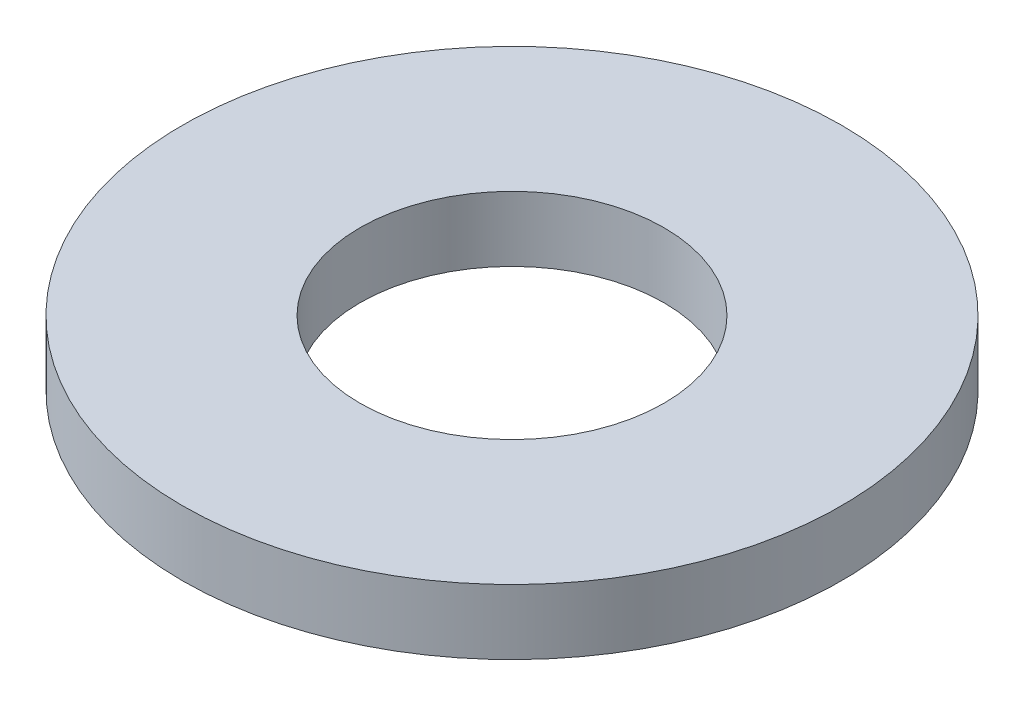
from build123d import *

# Parameters (mm, degrees)
SKETCH1_W = 2.5654
SKETCH1_H = 0.9398


with BuildPart() as part:
    # Sketch1 → Revolve1 (revolve)
    with BuildSketch(Plane.XY, mode=Mode.PRIVATE) as revolve1_sk:
        with Locations((3.4798, 0.4699)):
            Rectangle(SKETCH1_W, SKETCH1_H)
    revolve(revolve1_sk.sketch.rotate(Axis((0, 0.9398, 0), (0, -1, 0)), 270), axis=Axis((0, 0.9398, 0), (0, -1, 0)))


solid = part.part
